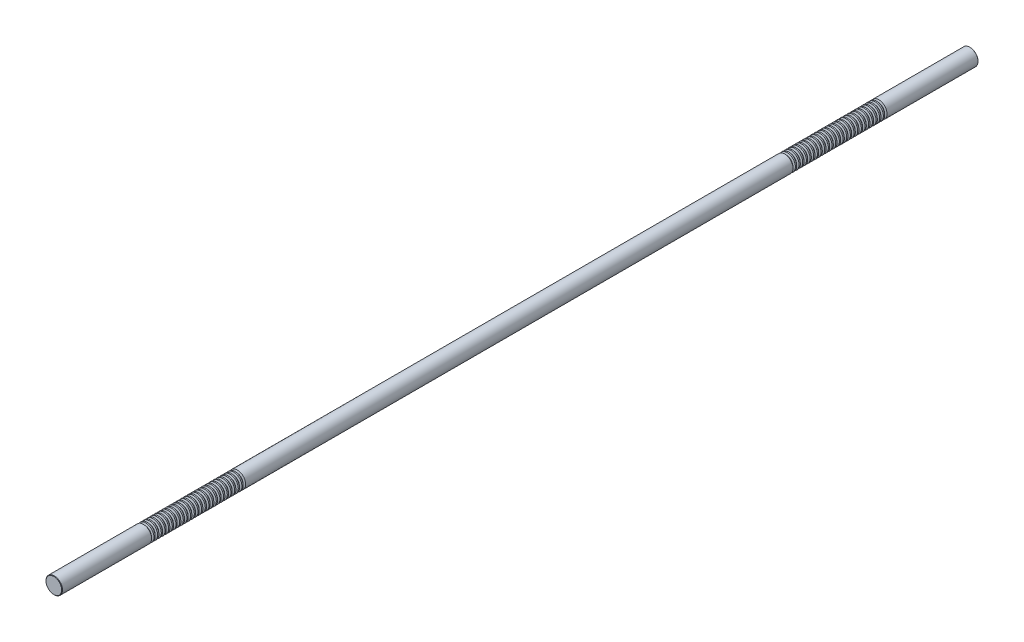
from build123d import *

# Parameters (mm, degrees)
SKETCH1_R           = 9
BOSS_EXTRUDE1_DEPTH = 500
CHAMFER1_SIZE       = 0.45
LPATTERN1_COUNT     = 26
LPATTERN1_PITCH     = 4
LPATTERN2_COUNT     = 2
LPATTERN2_PITCH     = 700


with BuildPart() as part:
    # Sketch1 → Boss-Extrude1 (new, symmetric)
    with BuildSketch(Plane.XY):
        Circle(SKETCH1_R)
    extrude(amount=BOSS_EXTRUDE1_DEPTH, both=True)

    # Chamfer1
    chamfer1_edges = [part.edges().sort_by_distance(p)[0] for p in [
        (-9, 0, -500),
        (-9, 0, 500),
    ]]
    chamfer(chamfer1_edges, length=CHAMFER1_SIZE)

    # Sketch2 → Cut-Revolve1 (revolve, cut)
    with BuildSketch(Plane(origin=(0, 0, 0), x_dir=(0, 0, -1), z_dir=(1, 0, 0)), mode=Mode.PRIVATE) as cut_revolve1_sk:
        Polygon((400.301442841, 9), (397.698557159, 9), (398.301442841, 6.75), (399.698557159, 6.75), align=None)
    cut_revolve1 = revolve(cut_revolve1_sk.sketch.rotate(Axis((0, 0, 500), (0, 0, -1)), 90), axis=Axis((0, 0, 500), (0, 0, -1)), mode=Mode.SUBTRACT)

    # LPattern1: Cut-Revolve1 ×26
    with Locations(*[(0, 0, i * LPATTERN1_PITCH) for i in range(1, LPATTERN1_COUNT)]):
        add(cut_revolve1, mode=Mode.SUBTRACT)

    # LPattern2: Cut-Revolve1 ×2
    with Locations(*[(0, 0, i * LPATTERN2_PITCH) for i in range(1, LPATTERN2_COUNT)]):
        add(cut_revolve1, mode=Mode.SUBTRACT)

    # LPattern2 copy 1 sketch → LPattern2 copy 1 (revolve, cut)
    with BuildSketch(Plane(origin=(0, 0, 704), x_dir=(0, 0, -1), z_dir=(1, 0, 0))):
        Polygon((400.301442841, 9), (397.698557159, 9), (398.301442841, 6.75), (399.698557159, 6.75), align=None)
    revolve(axis=Axis((0, 0, 1204), (0, 0, -1)), mode=Mode.SUBTRACT)

    # LPattern2 copy 2 sketch → LPattern2 copy 2 (revolve, cut)
    with BuildSketch(Plane(origin=(0, 0, 708), x_dir=(0, 0, -1), z_dir=(1, 0, 0))):
        Polygon((400.301442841, 9), (397.698557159, 9), (398.301442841, 6.75), (399.698557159, 6.75), align=None)
    revolve(axis=Axis((0, 0, 1208), (0, 0, -1)), mode=Mode.SUBTRACT)

    # LPattern2 copy 3 sketch → LPattern2 copy 3 (revolve, cut)
    with BuildSketch(Plane(origin=(0, 0, 712), x_dir=(0, 0, -1), z_dir=(1, 0, 0))):
        Polygon((400.301442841, 9), (397.698557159, 9), (398.301442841, 6.75), (399.698557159, 6.75), align=None)
    revolve(axis=Axis((0, 0, 1212), (0, 0, -1)), mode=Mode.SUBTRACT)

    # LPattern2 copy 4 sketch → LPattern2 copy 4 (revolve, cut)
    with BuildSketch(Plane(origin=(0, 0, 716), x_dir=(0, 0, -1), z_dir=(1, 0, 0))):
        Polygon((400.301442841, 9), (397.698557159, 9), (398.301442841, 6.75), (399.698557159, 6.75), align=None)
    revolve(axis=Axis((0, 0, 1216), (0, 0, -1)), mode=Mode.SUBTRACT)

    # LPattern2 copy 5 sketch → LPattern2 copy 5 (revolve, cut)
    with BuildSketch(Plane(origin=(0, 0, 720), x_dir=(0, 0, -1), z_dir=(1, 0, 0))):
        Polygon((400.301442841, 9), (397.698557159, 9), (398.301442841, 6.75), (399.698557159, 6.75), align=None)
    revolve(axis=Axis((0, 0, 1220), (0, 0, -1)), mode=Mode.SUBTRACT)

    # LPattern2 copy 6 sketch → LPattern2 copy 6 (revolve, cut)
    with BuildSketch(Plane(origin=(0, 0, 724), x_dir=(0, 0, -1), z_dir=(1, 0, 0))):
        Polygon((400.301442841, 9), (397.698557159, 9), (398.301442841, 6.75), (399.698557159, 6.75), align=None)
    revolve(axis=Axis((0, 0, 1224), (0, 0, -1)), mode=Mode.SUBTRACT)

    # LPattern2 copy 7 sketch → LPattern2 copy 7 (revolve, cut)
    with BuildSketch(Plane(origin=(0, 0, 728), x_dir=(0, 0, -1), z_dir=(1, 0, 0))):
        Polygon((400.301442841, 9), (397.698557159, 9), (398.301442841, 6.75), (399.698557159, 6.75), align=None)
    revolve(axis=Axis((0, 0, 1228), (0, 0, -1)), mode=Mode.SUBTRACT)

    # LPattern2 copy 8 sketch → LPattern2 copy 8 (revolve, cut)
    with BuildSketch(Plane(origin=(0, 0, 732), x_dir=(0, 0, -1), z_dir=(1, 0, 0))):
        Polygon((400.301442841, 9), (397.698557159, 9), (398.301442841, 6.75), (399.698557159, 6.75), align=None)
    revolve(axis=Axis((0, 0, 1232), (0, 0, -1)), mode=Mode.SUBTRACT)

    # LPattern2 copy 9 sketch → LPattern2 copy 9 (revolve, cut)
    with BuildSketch(Plane(origin=(0, 0, 736), x_dir=(0, 0, -1), z_dir=(1, 0, 0))):
        Polygon((400.301442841, 9), (397.698557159, 9), (398.301442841, 6.75), (399.698557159, 6.75), align=None)
    revolve(axis=Axis((0, 0, 1236), (0, 0, -1)), mode=Mode.SUBTRACT)

    # LPattern2 copy 10 sketch → LPattern2 copy 10 (revolve, cut)
    with BuildSketch(Plane(origin=(0, 0, 740), x_dir=(0, 0, -1), z_dir=(1, 0, 0))):
        Polygon((400.301442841, 9), (397.698557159, 9), (398.301442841, 6.75), (399.698557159, 6.75), align=None)
    revolve(axis=Axis((0, 0, 1240), (0, 0, -1)), mode=Mode.SUBTRACT)

    # LPattern2 copy 11 sketch → LPattern2 copy 11 (revolve, cut)
    with BuildSketch(Plane(origin=(0, 0, 744), x_dir=(0, 0, -1), z_dir=(1, 0, 0))):
        Polygon((400.301442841, 9), (397.698557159, 9), (398.301442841, 6.75), (399.698557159, 6.75), align=None)
    revolve(axis=Axis((0, 0, 1244), (0, 0, -1)), mode=Mode.SUBTRACT)

    # LPattern2 copy 12 sketch → LPattern2 copy 12 (revolve, cut)
    with BuildSketch(Plane(origin=(0, 0, 748), x_dir=(0, 0, -1), z_dir=(1, 0, 0))):
        Polygon((400.301442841, 9), (397.698557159, 9), (398.301442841, 6.75), (399.698557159, 6.75), align=None)
    revolve(axis=Axis((0, 0, 1248), (0, 0, -1)), mode=Mode.SUBTRACT)

    # LPattern2 copy 13 sketch → LPattern2 copy 13 (revolve, cut)
    with BuildSketch(Plane(origin=(0, 0, 752), x_dir=(0, 0, -1), z_dir=(1, 0, 0))):
        Polygon((400.301442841, 9), (397.698557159, 9), (398.301442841, 6.75), (399.698557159, 6.75), align=None)
    revolve(axis=Axis((0, 0, 1252), (0, 0, -1)), mode=Mode.SUBTRACT)

    # LPattern2 copy 14 sketch → LPattern2 copy 14 (revolve, cut)
    with BuildSketch(Plane(origin=(0, 0, 756), x_dir=(0, 0, -1), z_dir=(1, 0, 0))):
        Polygon((400.301442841, 9), (397.698557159, 9), (398.301442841, 6.75), (399.698557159, 6.75), align=None)
    revolve(axis=Axis((0, 0, 1256), (0, 0, -1)), mode=Mode.SUBTRACT)

    # LPattern2 copy 15 sketch → LPattern2 copy 15 (revolve, cut)
    with BuildSketch(Plane(origin=(0, 0, 760), x_dir=(0, 0, -1), z_dir=(1, 0, 0))):
        Polygon((400.301442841, 9), (397.698557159, 9), (398.301442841, 6.75), (399.698557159, 6.75), align=None)
    revolve(axis=Axis((0, 0, 1260), (0, 0, -1)), mode=Mode.SUBTRACT)

    # LPattern2 copy 16 sketch → LPattern2 copy 16 (revolve, cut)
    with BuildSketch(Plane(origin=(0, 0, 764), x_dir=(0, 0, -1), z_dir=(1, 0, 0))):
        Polygon((400.301442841, 9), (397.698557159, 9), (398.301442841, 6.75), (399.698557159, 6.75), align=None)
    revolve(axis=Axis((0, 0, 1264), (0, 0, -1)), mode=Mode.SUBTRACT)

    # LPattern2 copy 17 sketch → LPattern2 copy 17 (revolve, cut)
    with BuildSketch(Plane(origin=(0, 0, 768), x_dir=(0, 0, -1), z_dir=(1, 0, 0))):
        Polygon((400.301442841, 9), (397.698557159, 9), (398.301442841, 6.75), (399.698557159, 6.75), align=None)
    revolve(axis=Axis((0, 0, 1268), (0, 0, -1)), mode=Mode.SUBTRACT)

    # LPattern2 copy 18 sketch → LPattern2 copy 18 (revolve, cut)
    with BuildSketch(Plane(origin=(0, 0, 772), x_dir=(0, 0, -1), z_dir=(1, 0, 0))):
        Polygon((400.301442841, 9), (397.698557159, 9), (398.301442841, 6.75), (399.698557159, 6.75), align=None)
    revolve(axis=Axis((0, 0, 1272), (0, 0, -1)), mode=Mode.SUBTRACT)

    # LPattern2 copy 19 sketch → LPattern2 copy 19 (revolve, cut)
    with BuildSketch(Plane(origin=(0, 0, 776), x_dir=(0, 0, -1), z_dir=(1, 0, 0))):
        Polygon((400.301442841, 9), (397.698557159, 9), (398.301442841, 6.75), (399.698557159, 6.75), align=None)
    revolve(axis=Axis((0, 0, 1276), (0, 0, -1)), mode=Mode.SUBTRACT)

    # LPattern2 copy 20 sketch → LPattern2 copy 20 (revolve, cut)
    with BuildSketch(Plane(origin=(0, 0, 780), x_dir=(0, 0, -1), z_dir=(1, 0, 0))):
        Polygon((400.301442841, 9), (397.698557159, 9), (398.301442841, 6.75), (399.698557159, 6.75), align=None)
    revolve(axis=Axis((0, 0, 1280), (0, 0, -1)), mode=Mode.SUBTRACT)

    # LPattern2 copy 21 sketch → LPattern2 copy 21 (revolve, cut)
    with BuildSketch(Plane(origin=(0, 0, 784), x_dir=(0, 0, -1), z_dir=(1, 0, 0))):
        Polygon((400.301442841, 9), (397.698557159, 9), (398.301442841, 6.75), (399.698557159, 6.75), align=None)
    revolve(axis=Axis((0, 0, 1284), (0, 0, -1)), mode=Mode.SUBTRACT)

    # LPattern2 copy 22 sketch → LPattern2 copy 22 (revolve, cut)
    with BuildSketch(Plane(origin=(0, 0, 788), x_dir=(0, 0, -1), z_dir=(1, 0, 0))):
        Polygon((400.301442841, 9), (397.698557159, 9), (398.301442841, 6.75), (399.698557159, 6.75), align=None)
    revolve(axis=Axis((0, 0, 1288), (0, 0, -1)), mode=Mode.SUBTRACT)

    # LPattern2 copy 23 sketch → LPattern2 copy 23 (revolve, cut)
    with BuildSketch(Plane(origin=(0, 0, 792), x_dir=(0, 0, -1), z_dir=(1, 0, 0))):
        Polygon((400.301442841, 9), (397.698557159, 9), (398.301442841, 6.75), (399.698557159, 6.75), align=None)
    revolve(axis=Axis((0, 0, 1292), (0, 0, -1)), mode=Mode.SUBTRACT)

    # LPattern2 copy 24 sketch → LPattern2 copy 24 (revolve, cut)
    with BuildSketch(Plane(origin=(0, 0, 796), x_dir=(0, 0, -1), z_dir=(1, 0, 0))):
        Polygon((400.301442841, 9), (397.698557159, 9), (398.301442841, 6.75), (399.698557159, 6.75), align=None)
    revolve(axis=Axis((0, 0, 1296), (0, 0, -1)), mode=Mode.SUBTRACT)

    # LPattern2 copy 25 sketch → LPattern2 copy 25 (revolve, cut)
    with BuildSketch(Plane(origin=(0, 0, 800), x_dir=(0, 0, -1), z_dir=(1, 0, 0))):
        Polygon((400.301442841, 9), (397.698557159, 9), (398.301442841, 6.75), (399.698557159, 6.75), align=None)
    revolve(axis=Axis((0, 0, 1300), (0, 0, -1)), mode=Mode.SUBTRACT)


solid = part.part
